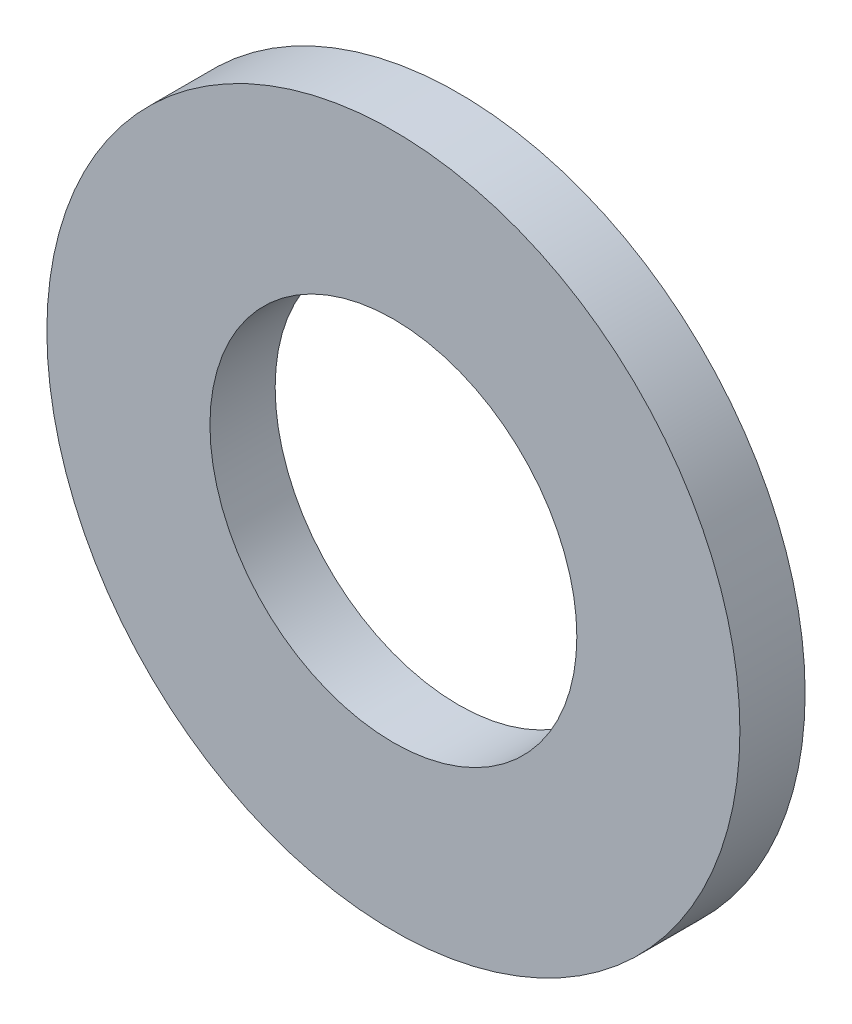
ISO-10303-21;
HEADER;
FILE_DESCRIPTION(('STEP AP214'),'2;1');
FILE_NAME('part.step','',(''),(''),'','','');
FILE_SCHEMA(('AUTOMOTIVE_DESIGN { 1 0 10303 214 1 1 1 1 }'));
ENDSEC;
DATA;
#1=APPLICATION_CONTEXT('core data for automotive mechanical design processes');
#2=APPLICATION_PROTOCOL_DEFINITION('international standard','automotive_design',2000,#1);
#3=PRODUCT_CONTEXT('',#1,'mechanical');
#4=PRODUCT('Part','Part','',(#3));
#5=PRODUCT_RELATED_PRODUCT_CATEGORY('part','',(#4));
#6=PRODUCT_DEFINITION_FORMATION('','',#4);
#7=PRODUCT_DEFINITION_CONTEXT('part definition',#1,'design');
#8=PRODUCT_DEFINITION('design','',#6,#7);
#9=PRODUCT_DEFINITION_SHAPE('','',#8);
#10=(LENGTH_UNIT() NAMED_UNIT(*) SI_UNIT(.MILLI.,.METRE.));
#11=(NAMED_UNIT(*) PLANE_ANGLE_UNIT() SI_UNIT($,.RADIAN.));
#12=(NAMED_UNIT(*) SI_UNIT($,.STERADIAN.) SOLID_ANGLE_UNIT());
#13=UNCERTAINTY_MEASURE_WITH_UNIT(LENGTH_MEASURE(1.E-05),#10,'distance_accuracy_value','');
#14=(GEOMETRIC_REPRESENTATION_CONTEXT(3) GLOBAL_UNCERTAINTY_ASSIGNED_CONTEXT((#13)) GLOBAL_UNIT_ASSIGNED_CONTEXT((#10,
#11,#12)) REPRESENTATION_CONTEXT('',''));
#15=CARTESIAN_POINT('',(0.,0.,0.));
#16=DIRECTION('',(0.,0.,1.));
#17=DIRECTION('',(1.,0.,0.));
#18=AXIS2_PLACEMENT_3D('',#15,#16,#17);
#19=CARTESIAN_POINT('',(0.,0.,1.6));
#20=DIRECTION('',(0.,0.,-1.));
#21=DIRECTION('',(-1.,0.,0.));
#22=AXIS2_PLACEMENT_3D('',#19,#20,#21);
#23=CYLINDRICAL_SURFACE('',#22,8.5);
#24=CARTESIAN_POINT('',(0.,0.,1.6));
#25=DIRECTION('',(0.,0.,1.));
#26=DIRECTION('',(1.,0.,0.));
#27=AXIS2_PLACEMENT_3D('',#24,#25,#26);
#28=CIRCLE('',#27,8.5);
#29=CARTESIAN_POINT('',(8.5,0.,1.6));
#30=VERTEX_POINT('',#29);
#31=EDGE_CURVE('E8',#30,#30,#28,.T.);
#32=ORIENTED_EDGE('',*,*,#31,.F.);
#33=EDGE_LOOP('',(#32));
#34=FACE_BOUND('',#33,.T.);
#35=CARTESIAN_POINT('',(0.,0.,0.));
#36=DIRECTION('',(0.,0.,1.));
#37=DIRECTION('',(1.,0.,0.));
#38=AXIS2_PLACEMENT_3D('',#35,#36,#37);
#39=CIRCLE('',#38,8.5);
#40=CARTESIAN_POINT('',(8.5,0.,0.));
#41=VERTEX_POINT('',#40);
#42=EDGE_CURVE('E18',#41,#41,#39,.T.);
#43=ORIENTED_EDGE('',*,*,#42,.T.);
#44=EDGE_LOOP('',(#43));
#45=FACE_BOUND('',#44,.T.);
#46=ADVANCED_FACE('F12',(#34,#45),#23,.T.);
#47=CARTESIAN_POINT('',(0.,0.,0.));
#48=DIRECTION('',(0.,0.,1.));
#49=DIRECTION('',(1.,0.,0.));
#50=AXIS2_PLACEMENT_3D('',#47,#48,#49);
#51=PLANE('',#50);
#52=ORIENTED_EDGE('',*,*,#42,.F.);
#53=EDGE_LOOP('',(#52));
#54=FACE_BOUND('',#53,.T.);
#55=CARTESIAN_POINT('',(0.,0.,0.));
#56=DIRECTION('',(0.,0.,1.));
#57=DIRECTION('',(0.,-1.,0.));
#58=AXIS2_PLACEMENT_3D('',#55,#56,#57);
#59=CIRCLE('',#58,4.5);
#60=CARTESIAN_POINT('',(0.,-4.5,0.));
#61=VERTEX_POINT('',#60);
#62=EDGE_CURVE('E26',#61,#61,#59,.T.);
#63=ORIENTED_EDGE('',*,*,#62,.T.);
#64=EDGE_LOOP('',(#63));
#65=FACE_BOUND('',#64,.T.);
#66=ADVANCED_FACE('F32',(#54,#65),#51,.F.);
#67=CARTESIAN_POINT('',(0.,0.,1.6));
#68=DIRECTION('',(0.,0.,1.));
#69=DIRECTION('',(1.,0.,0.));
#70=AXIS2_PLACEMENT_3D('',#67,#68,#69);
#71=PLANE('',#70);
#72=ORIENTED_EDGE('',*,*,#31,.T.);
#73=EDGE_LOOP('',(#72));
#74=FACE_BOUND('',#73,.T.);
#75=CARTESIAN_POINT('',(0.,0.,1.6));
#76=DIRECTION('',(0.,0.,1.));
#77=DIRECTION('',(1.,0.,0.));
#78=AXIS2_PLACEMENT_3D('',#75,#76,#77);
#79=CIRCLE('',#78,4.5);
#80=CARTESIAN_POINT('',(4.5,0.,1.6));
#81=VERTEX_POINT('',#80);
#82=EDGE_CURVE('E22',#81,#81,#79,.T.);
#83=ORIENTED_EDGE('',*,*,#82,.F.);
#84=EDGE_LOOP('',(#83));
#85=FACE_BOUND('',#84,.T.);
#86=ADVANCED_FACE('F36',(#74,#85),#71,.T.);
#87=CARTESIAN_POINT('',(0.,0.,1.6));
#88=DIRECTION('',(0.,0.,-1.));
#89=DIRECTION('',(-1.,0.,0.));
#90=AXIS2_PLACEMENT_3D('',#87,#88,#89);
#91=CYLINDRICAL_SURFACE('',#90,4.5);
#92=ORIENTED_EDGE('',*,*,#82,.T.);
#93=EDGE_LOOP('',(#92));
#94=FACE_BOUND('',#93,.T.);
#95=ORIENTED_EDGE('',*,*,#62,.F.);
#96=EDGE_LOOP('',(#95));
#97=FACE_BOUND('',#96,.T.);
#98=ADVANCED_FACE('F34',(#94,#97),#91,.F.);
#99=CLOSED_SHELL('',(#46,#66,#86,#98));
#100=MANIFOLD_SOLID_BREP('B1',#99);
#101=ADVANCED_BREP_SHAPE_REPRESENTATION('',(#18,#100),#14);
#102=SHAPE_DEFINITION_REPRESENTATION(#9,#101);
ENDSEC;
END-ISO-10303-21;
